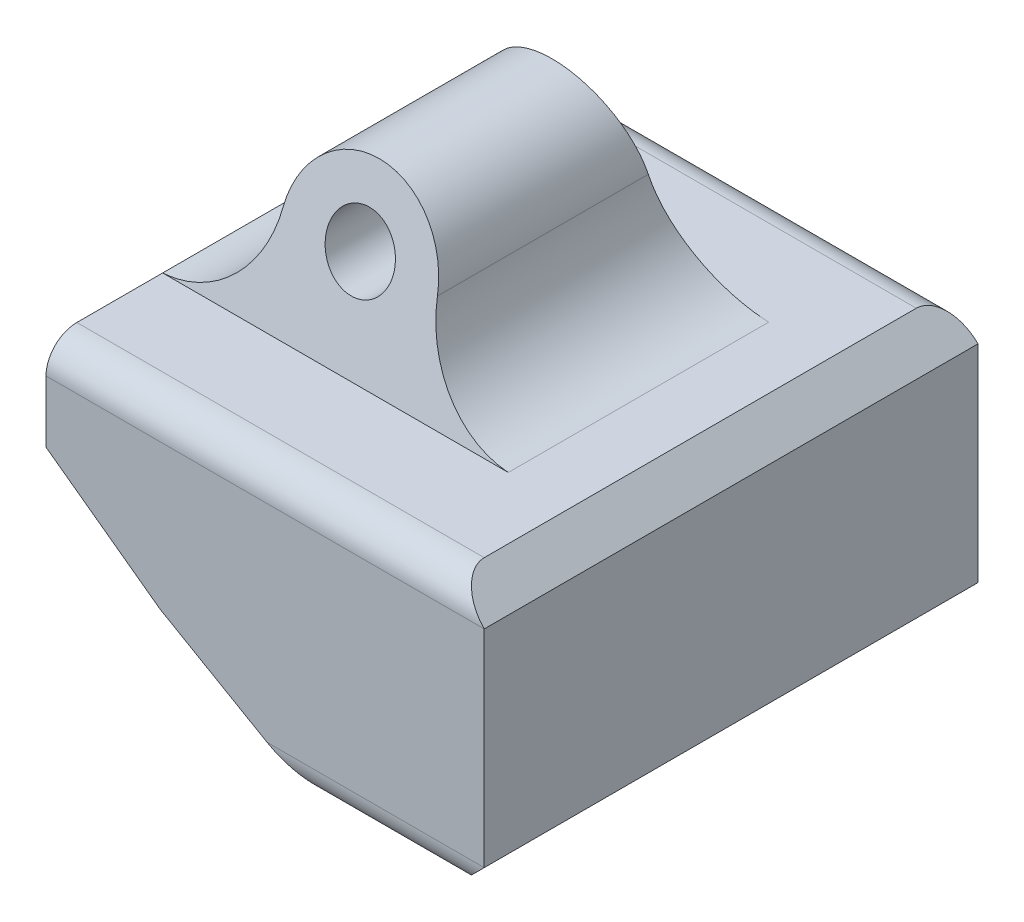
ISO-10303-21;
HEADER;
FILE_DESCRIPTION(('STEP AP214'),'2;1');
FILE_NAME('part.step','',(''),(''),'','','');
FILE_SCHEMA(('AUTOMOTIVE_DESIGN { 1 0 10303 214 1 1 1 1 }'));
ENDSEC;
DATA;
#1=APPLICATION_CONTEXT('core data for automotive mechanical design processes');
#2=APPLICATION_PROTOCOL_DEFINITION('international standard','automotive_design',2000,#1);
#3=PRODUCT_CONTEXT('',#1,'mechanical');
#4=PRODUCT('Part','Part','',(#3));
#5=PRODUCT_RELATED_PRODUCT_CATEGORY('part','',(#4));
#6=PRODUCT_DEFINITION_FORMATION('','',#4);
#7=PRODUCT_DEFINITION_CONTEXT('part definition',#1,'design');
#8=PRODUCT_DEFINITION('design','',#6,#7);
#9=PRODUCT_DEFINITION_SHAPE('','',#8);
#10=(LENGTH_UNIT() NAMED_UNIT(*) SI_UNIT(.MILLI.,.METRE.));
#11=(NAMED_UNIT(*) PLANE_ANGLE_UNIT() SI_UNIT($,.RADIAN.));
#12=(NAMED_UNIT(*) SI_UNIT($,.STERADIAN.) SOLID_ANGLE_UNIT());
#13=UNCERTAINTY_MEASURE_WITH_UNIT(LENGTH_MEASURE(1.E-05),#10,'distance_accuracy_value','');
#14=(GEOMETRIC_REPRESENTATION_CONTEXT(3) GLOBAL_UNCERTAINTY_ASSIGNED_CONTEXT((#13)) GLOBAL_UNIT_ASSIGNED_CONTEXT((#10,
#11,#12)) REPRESENTATION_CONTEXT('',''));
#15=CARTESIAN_POINT('',(0.,0.,0.));
#16=DIRECTION('',(0.,0.,1.));
#17=DIRECTION('',(1.,0.,0.));
#18=AXIS2_PLACEMENT_3D('',#15,#16,#17);
#19=CARTESIAN_POINT('',(-69.6,13.2,-8.));
#20=DIRECTION('',(-0.589469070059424,-0.807790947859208,0.));
#21=DIRECTION('',(0.807790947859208,-0.589469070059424,0.));
#22=AXIS2_PLACEMENT_3D('',#19,#20,#21);
#23=PLANE('',#22);
#24=DIRECTION('',(-0.807790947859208,0.589469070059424,0.));
#25=VECTOR('',#24,1.);
#26=CARTESIAN_POINT('',(-69.6,13.2,6.));
#27=LINE('',#26,#25);
#28=CARTESIAN_POINT('',(-65.9,10.5,6.));
#29=VERTEX_POINT('',#28);
#30=CARTESIAN_POINT('',(-69.6,13.2,6.));
#31=VERTEX_POINT('',#30);
#32=EDGE_CURVE('E220',#29,#31,#27,.T.);
#33=ORIENTED_EDGE('',*,*,#32,.F.);
#34=DIRECTION('',(0.,0.,1.));
#35=VECTOR('',#34,1.);
#36=CARTESIAN_POINT('',(-65.9,10.5,-8.));
#37=LINE('',#36,#35);
#38=CARTESIAN_POINT('',(-65.9,10.5,8.));
#39=VERTEX_POINT('',#38);
#40=EDGE_CURVE('E341',#29,#39,#37,.T.);
#41=ORIENTED_EDGE('',*,*,#40,.T.);
#42=DIRECTION('',(0.807790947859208,-0.589469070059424,0.));
#43=VECTOR('',#42,1.);
#44=CARTESIAN_POINT('',(-69.6,13.2,8.));
#45=LINE('',#44,#43);
#46=CARTESIAN_POINT('',(-69.6,13.2,8.));
#47=VERTEX_POINT('',#46);
#48=EDGE_CURVE('E322',#47,#39,#45,.T.);
#49=ORIENTED_EDGE('',*,*,#48,.F.);
#50=DIRECTION('',(0.,0.,1.));
#51=VECTOR('',#50,1.);
#52=CARTESIAN_POINT('',(-69.6,13.2,-8.));
#53=LINE('',#52,#51);
#54=EDGE_CURVE('E195',#31,#47,#53,.T.);
#55=ORIENTED_EDGE('',*,*,#54,.F.);
#56=EDGE_LOOP('',(#33,#41,#49,#55));
#57=FACE_BOUND('',#56,.T.);
#58=ADVANCED_FACE('F37',(#57),#23,.T.);
#59=CARTESIAN_POINT('',(-55.4,16.2,-8.));
#60=DIRECTION('',(0.,1.,0.));
#61=DIRECTION('',(0.,0.,1.));
#62=AXIS2_PLACEMENT_3D('',#59,#60,#61);
#63=PLANE('',#62);
#64=DIRECTION('',(0.,0.,1.));
#65=VECTOR('',#64,1.);
#66=CARTESIAN_POINT('',(-58.4,16.2,-7.));
#67=LINE('',#66,#65);
#68=CARTESIAN_POINT('',(-58.4,16.2,-4.22013071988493));
#69=VERTEX_POINT('',#68);
#70=CARTESIAN_POINT('',(-58.3999999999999,16.2,4.22013071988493));
#71=VERTEX_POINT('',#70);
#72=EDGE_CURVE('E285',#69,#71,#67,.T.);
#73=ORIENTED_EDGE('',*,*,#72,.T.);
#74=DIRECTION('',(-1.,0.,0.));
#75=VECTOR('',#74,1.);
#76=CARTESIAN_POINT('',(-54.6,16.2,4.22013071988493));
#77=LINE('',#76,#75);
#78=CARTESIAN_POINT('',(-69.6,16.2,4.22013071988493));
#79=VERTEX_POINT('',#78);
#80=EDGE_CURVE('E187',#71,#79,#77,.T.);
#81=ORIENTED_EDGE('',*,*,#80,.T.);
#82=DIRECTION('',(0.,0.,1.));
#83=VECTOR('',#82,1.);
#84=CARTESIAN_POINT('',(-69.6,16.2,9.76990159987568));
#85=LINE('',#84,#83);
#86=CARTESIAN_POINT('',(-69.6,16.2,7.));
#87=VERTEX_POINT('',#86);
#88=EDGE_CURVE('E188',#79,#87,#85,.T.);
#89=ORIENTED_EDGE('',*,*,#88,.T.);
#90=DIRECTION('',(-1.,0.,0.));
#91=VECTOR('',#90,1.);
#92=CARTESIAN_POINT('',(-55.4,16.2,7.));
#93=LINE('',#92,#91);
#94=CARTESIAN_POINT('',(-56.4,16.2,7.));
#95=VERTEX_POINT('',#94);
#96=EDGE_CURVE('E61',#87,#95,#93,.F.);
#97=ORIENTED_EDGE('',*,*,#96,.T.);
#98=DIRECTION('',(0.,0.,-1.));
#99=VECTOR('',#98,1.);
#100=CARTESIAN_POINT('',(-56.4,16.2,-8.));
#101=LINE('',#100,#99);
#102=CARTESIAN_POINT('',(-56.4,16.2,-7.));
#103=VERTEX_POINT('',#102);
#104=EDGE_CURVE('E47',#95,#103,#101,.T.);
#105=ORIENTED_EDGE('',*,*,#104,.T.);
#106=DIRECTION('',(1.,0.,0.));
#107=VECTOR('',#106,1.);
#108=CARTESIAN_POINT('',(-58.4,16.2,-7.));
#109=LINE('',#108,#107);
#110=CARTESIAN_POINT('',(-69.6,16.2,-7.));
#111=VERTEX_POINT('',#110);
#112=EDGE_CURVE('E54',#111,#103,#109,.T.);
#113=ORIENTED_EDGE('',*,*,#112,.F.);
#114=DIRECTION('',(0.,0.,1.));
#115=VECTOR('',#114,1.);
#116=CARTESIAN_POINT('',(-69.6,16.2,-8.));
#117=LINE('',#116,#115);
#118=CARTESIAN_POINT('',(-69.6,16.2,-4.22013071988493));
#119=VERTEX_POINT('',#118);
#120=EDGE_CURVE('E191',#111,#119,#117,.T.);
#121=ORIENTED_EDGE('',*,*,#120,.T.);
#122=DIRECTION('',(-1.,0.,0.));
#123=VECTOR('',#122,1.);
#124=CARTESIAN_POINT('',(-54.6,16.2,-4.22013071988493));
#125=LINE('',#124,#123);
#126=EDGE_CURVE('E176',#69,#119,#125,.T.);
#127=ORIENTED_EDGE('',*,*,#126,.F.);
#128=EDGE_LOOP('',(#73,#81,#89,#97,#105,#113,#121,#127));
#129=FACE_BOUND('',#128,.T.);
#130=ADVANCED_FACE('F192',(#129),#63,.T.);
#131=CARTESIAN_POINT('',(-55.4,16.2,-8.));
#132=DIRECTION('',(1.,0.,0.));
#133=DIRECTION('',(0.,0.,-1.));
#134=AXIS2_PLACEMENT_3D('',#131,#132,#133);
#135=PLANE('',#134);
#136=DIRECTION('',(0.,1.,0.));
#137=VECTOR('',#136,1.);
#138=CARTESIAN_POINT('',(-55.4,16.2,8.));
#139=LINE('',#138,#137);
#140=CARTESIAN_POINT('',(-55.4,8.49999999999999,8.));
#141=VERTEX_POINT('',#140);
#142=CARTESIAN_POINT('',(-55.4,15.2,8.));
#143=VERTEX_POINT('',#142);
#144=EDGE_CURVE('E328',#141,#143,#139,.T.);
#145=ORIENTED_EDGE('',*,*,#144,.F.);
#146=DIRECTION('',(0.,0.,-1.));
#147=VECTOR('',#146,1.);
#148=CARTESIAN_POINT('',(-55.4,8.49999999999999,-8.));
#149=LINE('',#148,#147);
#150=CARTESIAN_POINT('',(-55.4,8.49999999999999,-8.));
#151=VERTEX_POINT('',#150);
#152=EDGE_CURVE('E261',#141,#151,#149,.T.);
#153=ORIENTED_EDGE('',*,*,#152,.T.);
#154=DIRECTION('',(0.,1.,0.));
#155=VECTOR('',#154,1.);
#156=CARTESIAN_POINT('',(-55.4,16.2,-8.));
#157=LINE('',#156,#155);
#158=CARTESIAN_POINT('',(-55.4,15.2,-8.));
#159=VERTEX_POINT('',#158);
#160=EDGE_CURVE('E210',#151,#159,#157,.T.);
#161=ORIENTED_EDGE('',*,*,#160,.T.);
#162=DIRECTION('',(0.,0.,1.));
#163=VECTOR('',#162,1.);
#164=CARTESIAN_POINT('',(-55.4,15.2,-8.));
#165=LINE('',#164,#163);
#166=EDGE_CURVE('E258',#159,#143,#165,.T.);
#167=ORIENTED_EDGE('',*,*,#166,.T.);
#168=EDGE_LOOP('',(#145,#153,#161,#167));
#169=FACE_BOUND('',#168,.T.);
#170=ADVANCED_FACE('F371',(#169),#135,.T.);
#171=CARTESIAN_POINT('',(-60.7038475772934,7.49999999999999,-8.));
#172=DIRECTION('',(0.,-1.,0.));
#173=DIRECTION('',(0.,0.,-1.));
#174=AXIS2_PLACEMENT_3D('',#171,#172,#173);
#175=PLANE('',#174);
#176=DIRECTION('',(1.,0.,0.));
#177=VECTOR('',#176,1.);
#178=CARTESIAN_POINT('',(-55.4,7.49999999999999,-7.));
#179=LINE('',#178,#177);
#180=CARTESIAN_POINT('',(-60.7038475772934,7.49999999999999,-7.));
#181=VERTEX_POINT('',#180);
#182=CARTESIAN_POINT('',(-56.4,7.49999999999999,-7.));
#183=VERTEX_POINT('',#182);
#184=EDGE_CURVE('E234',#181,#183,#179,.T.);
#185=ORIENTED_EDGE('',*,*,#184,.T.);
#186=DIRECTION('',(0.,0.,1.));
#187=VECTOR('',#186,1.);
#188=CARTESIAN_POINT('',(-56.4,7.49999999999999,-8.));
#189=LINE('',#188,#187);
#190=CARTESIAN_POINT('',(-56.4,7.49999999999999,7.));
#191=VERTEX_POINT('',#190);
#192=EDGE_CURVE('E253',#183,#191,#189,.T.);
#193=ORIENTED_EDGE('',*,*,#192,.T.);
#194=DIRECTION('',(1.,0.,0.));
#195=VECTOR('',#194,1.);
#196=CARTESIAN_POINT('',(-60.7038475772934,7.49999999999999,7.));
#197=LINE('',#196,#195);
#198=CARTESIAN_POINT('',(-60.7038475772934,7.49999999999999,7.));
#199=VERTEX_POINT('',#198);
#200=EDGE_CURVE('E237',#191,#199,#197,.F.);
#201=ORIENTED_EDGE('',*,*,#200,.T.);
#202=DIRECTION('',(0.,0.,1.));
#203=VECTOR('',#202,1.);
#204=CARTESIAN_POINT('',(-60.7038475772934,7.49999999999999,-8.));
#205=LINE('',#204,#203);
#206=EDGE_CURVE('E221',#181,#199,#205,.T.);
#207=ORIENTED_EDGE('',*,*,#206,.F.);
#208=EDGE_LOOP('',(#185,#193,#201,#207));
#209=FACE_BOUND('',#208,.T.);
#210=ADVANCED_FACE('F384',(#209),#175,.T.);
#211=CARTESIAN_POINT('',(-65.9,10.5,-8.));
#212=DIRECTION('',(-0.500000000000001,-0.866025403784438,0.));
#213=DIRECTION('',(0.866025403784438,-0.500000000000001,0.));
#214=AXIS2_PLACEMENT_3D('',#211,#212,#213);
#215=PLANE('',#214);
#216=CARTESIAN_POINT('',(-64.,9.40303448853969,0.));
#217=DIRECTION('',(-0.500000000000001,-0.866025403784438,0.));
#218=DIRECTION('',(-0.866025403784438,0.500000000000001,0.));
#219=AXIS2_PLACEMENT_3D('',#216,#217,#218);
#220=ELLIPSE('',#219,2.88675134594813,2.49999999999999);
#221=CARTESIAN_POINT('',(-65.3803847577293,10.2,-2.0843555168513));
#222=VERTEX_POINT('',#221);
#223=CARTESIAN_POINT('',(-65.3803847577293,10.2,2.0843555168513));
#224=VERTEX_POINT('',#223);
#225=EDGE_CURVE('E293',#222,#224,#220,.T.);
#226=ORIENTED_EDGE('',*,*,#225,.F.);
#227=DIRECTION('',(0.,0.,1.));
#228=VECTOR('',#227,1.);
#229=CARTESIAN_POINT('',(-65.3803847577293,10.2,-8.));
#230=LINE('',#229,#228);
#231=CARTESIAN_POINT('',(-65.3803847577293,10.2,-6.));
#232=VERTEX_POINT('',#231);
#233=EDGE_CURVE('E225',#232,#222,#230,.T.);
#234=ORIENTED_EDGE('',*,*,#233,.F.);
#235=DIRECTION('',(0.866025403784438,-0.500000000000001,0.));
#236=VECTOR('',#235,1.);
#237=CARTESIAN_POINT('',(-65.9,10.5,-6.));
#238=LINE('',#237,#236);
#239=CARTESIAN_POINT('',(-65.9,10.5,-6.));
#240=VERTEX_POINT('',#239);
#241=EDGE_CURVE('E315',#240,#232,#238,.T.);
#242=ORIENTED_EDGE('',*,*,#241,.F.);
#243=CARTESIAN_POINT('',(-65.9,10.5,-8.));
#244=VERTEX_POINT('',#243);
#245=EDGE_CURVE('E339',#244,#240,#37,.T.);
#246=ORIENTED_EDGE('',*,*,#245,.F.);
#247=DIRECTION('',(0.866025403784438,-0.500000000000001,0.));
#248=VECTOR('',#247,1.);
#249=CARTESIAN_POINT('',(-65.9,10.5,-8.));
#250=LINE('',#249,#248);
#251=CARTESIAN_POINT('',(-62.4358983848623,8.49999999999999,-8.));
#252=VERTEX_POINT('',#251);
#253=EDGE_CURVE('E212',#244,#252,#250,.T.);
#254=ORIENTED_EDGE('',*,*,#253,.T.);
#255=CARTESIAN_POINT('',(-62.4358983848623,8.49999999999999,-7.));
#256=DIRECTION('',(-0.500000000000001,-0.866025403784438,0.));
#257=DIRECTION('',(-0.866025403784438,0.500000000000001,0.));
#258=AXIS2_PLACEMENT_3D('',#255,#256,#257);
#259=ELLIPSE('',#258,2.,1.);
#260=EDGE_CURVE('E239',#252,#181,#259,.T.);
#261=ORIENTED_EDGE('',*,*,#260,.T.);
#262=ORIENTED_EDGE('',*,*,#206,.T.);
#263=CARTESIAN_POINT('',(-62.4358983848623,8.49999999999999,7.));
#264=DIRECTION('',(-0.500000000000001,-0.866025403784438,0.));
#265=DIRECTION('',(0.866025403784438,-0.500000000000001,0.));
#266=AXIS2_PLACEMENT_3D('',#263,#264,#265);
#267=ELLIPSE('',#266,2.,1.);
#268=CARTESIAN_POINT('',(-62.4358983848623,8.49999999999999,8.));
#269=VERTEX_POINT('',#268);
#270=EDGE_CURVE('E241',#199,#269,#267,.T.);
#271=ORIENTED_EDGE('',*,*,#270,.T.);
#272=DIRECTION('',(0.866025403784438,-0.500000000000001,0.));
#273=VECTOR('',#272,1.);
#274=CARTESIAN_POINT('',(-65.9,10.5,8.));
#275=LINE('',#274,#273);
#276=EDGE_CURVE('E325',#39,#269,#275,.T.);
#277=ORIENTED_EDGE('',*,*,#276,.F.);
#278=ORIENTED_EDGE('',*,*,#40,.F.);
#279=DIRECTION('',(-0.866025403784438,0.500000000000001,0.));
#280=VECTOR('',#279,1.);
#281=CARTESIAN_POINT('',(-65.9,10.5,6.));
#282=LINE('',#281,#280);
#283=CARTESIAN_POINT('',(-65.3803847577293,10.2,6.));
#284=VERTEX_POINT('',#283);
#285=EDGE_CURVE('E318',#284,#29,#282,.T.);
#286=ORIENTED_EDGE('',*,*,#285,.F.);
#287=EDGE_CURVE('E224',#224,#284,#230,.T.);
#288=ORIENTED_EDGE('',*,*,#287,.F.);
#289=EDGE_LOOP('',(#226,#234,#242,#246,#254,#261,#262,#271,#277,#278,#286,#288));
#290=FACE_BOUND('',#289,.T.);
#291=ADVANCED_FACE('F360',(#290),#215,.T.);
#292=DIRECTION('',(0.807790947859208,-0.589469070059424,0.));
#293=VECTOR('',#292,1.);
#294=CARTESIAN_POINT('',(-69.6,13.2,-6.));
#295=LINE('',#294,#293);
#296=CARTESIAN_POINT('',(-69.6,13.2,-6.));
#297=VERTEX_POINT('',#296);
#298=EDGE_CURVE('E218',#297,#240,#295,.T.);
#299=ORIENTED_EDGE('',*,*,#298,.F.);
#300=CARTESIAN_POINT('',(-69.6,13.2,-8.));
#301=VERTEX_POINT('',#300);
#302=EDGE_CURVE('E216',#301,#297,#53,.T.);
#303=ORIENTED_EDGE('',*,*,#302,.F.);
#304=DIRECTION('',(0.807790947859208,-0.589469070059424,0.));
#305=VECTOR('',#304,1.);
#306=CARTESIAN_POINT('',(-69.6,13.2,-8.));
#307=LINE('',#306,#305);
#308=EDGE_CURVE('E333',#301,#244,#307,.T.);
#309=ORIENTED_EDGE('',*,*,#308,.T.);
#310=ORIENTED_EDGE('',*,*,#245,.T.);
#311=EDGE_LOOP('',(#299,#303,#309,#310));
#312=FACE_BOUND('',#311,.T.);
#313=ADVANCED_FACE('F391',(#312),#23,.T.);
#314=CARTESIAN_POINT('',(-69.6,16.2,-8.));
#315=DIRECTION('',(-1.,0.,0.));
#316=DIRECTION('',(0.,0.,1.));
#317=AXIS2_PLACEMENT_3D('',#314,#315,#316);
#318=PLANE('',#317);
#319=DIRECTION('',(0.,-1.,0.));
#320=VECTOR('',#319,1.);
#321=CARTESIAN_POINT('',(-69.6,16.2,8.));
#322=LINE('',#321,#320);
#323=CARTESIAN_POINT('',(-69.6,15.2,8.));
#324=VERTEX_POINT('',#323);
#325=EDGE_CURVE('E320',#324,#47,#322,.T.);
#326=ORIENTED_EDGE('',*,*,#325,.F.);
#327=CARTESIAN_POINT('',(-69.6,15.2,7.));
#328=DIRECTION('',(-1.,0.,0.));
#329=DIRECTION('',(0.,0.,1.));
#330=AXIS2_PLACEMENT_3D('',#327,#328,#329);
#331=CIRCLE('',#330,1.);
#332=EDGE_CURVE('E245',#324,#87,#331,.T.);
#333=ORIENTED_EDGE('',*,*,#332,.T.);
#334=ORIENTED_EDGE('',*,*,#88,.F.);
#335=EDGE_CURVE('E196',#119,#79,#117,.T.);
#336=ORIENTED_EDGE('',*,*,#335,.F.);
#337=ORIENTED_EDGE('',*,*,#120,.F.);
#338=CARTESIAN_POINT('',(-69.6,15.2,-7.));
#339=DIRECTION('',(-1.,0.,0.));
#340=DIRECTION('',(0.,0.,1.));
#341=AXIS2_PLACEMENT_3D('',#338,#339,#340);
#342=CIRCLE('',#341,1.);
#343=CARTESIAN_POINT('',(-69.6,15.2,-8.));
#344=VERTEX_POINT('',#343);
#345=EDGE_CURVE('E243',#111,#344,#342,.T.);
#346=ORIENTED_EDGE('',*,*,#345,.T.);
#347=DIRECTION('',(0.,-1.,0.));
#348=VECTOR('',#347,1.);
#349=CARTESIAN_POINT('',(-69.6,16.2,-8.));
#350=LINE('',#349,#348);
#351=EDGE_CURVE('E331',#344,#301,#350,.T.);
#352=ORIENTED_EDGE('',*,*,#351,.T.);
#353=ORIENTED_EDGE('',*,*,#302,.T.);
#354=EDGE_CURVE('E349',#297,#31,#53,.T.);
#355=ORIENTED_EDGE('',*,*,#354,.T.);
#356=ORIENTED_EDGE('',*,*,#54,.T.);
#357=EDGE_LOOP('',(#326,#333,#334,#336,#337,#346,#352,#353,#355,#356));
#358=FACE_BOUND('',#357,.T.);
#359=ADVANCED_FACE('F208',(#358),#318,.T.);
#360=CARTESIAN_POINT('',(0.,0.,-8.));
#361=DIRECTION('',(0.,0.,1.));
#362=DIRECTION('',(1.,0.,0.));
#363=AXIS2_PLACEMENT_3D('',#360,#361,#362);
#364=PLANE('',#363);
#365=ORIENTED_EDGE('',*,*,#160,.F.);
#366=DIRECTION('',(1.,0.,0.));
#367=VECTOR('',#366,1.);
#368=CARTESIAN_POINT('',(-60.7038475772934,8.49999999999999,-8.));
#369=LINE('',#368,#367);
#370=EDGE_CURVE('E251',#151,#252,#369,.F.);
#371=ORIENTED_EDGE('',*,*,#370,.T.);
#372=ORIENTED_EDGE('',*,*,#253,.F.);
#373=ORIENTED_EDGE('',*,*,#308,.F.);
#374=ORIENTED_EDGE('',*,*,#351,.F.);
#375=DIRECTION('',(-1.,0.,0.));
#376=VECTOR('',#375,1.);
#377=CARTESIAN_POINT('',(-55.4,15.2,-8.));
#378=LINE('',#377,#376);
#379=EDGE_CURVE('E248',#344,#159,#378,.F.);
#380=ORIENTED_EDGE('',*,*,#379,.T.);
#381=EDGE_LOOP('',(#365,#371,#372,#373,#374,#380));
#382=FACE_BOUND('',#381,.T.);
#383=ADVANCED_FACE('F405',(#382),#364,.F.);
#384=CARTESIAN_POINT('',(0.,0.,8.));
#385=DIRECTION('',(0.,0.,1.));
#386=DIRECTION('',(1.,0.,0.));
#387=AXIS2_PLACEMENT_3D('',#384,#385,#386);
#388=PLANE('',#387);
#389=ORIENTED_EDGE('',*,*,#276,.T.);
#390=DIRECTION('',(1.,0.,0.));
#391=VECTOR('',#390,1.);
#392=CARTESIAN_POINT('',(0.,8.49999999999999,8.));
#393=LINE('',#392,#391);
#394=EDGE_CURVE('E231',#269,#141,#393,.T.);
#395=ORIENTED_EDGE('',*,*,#394,.T.);
#396=ORIENTED_EDGE('',*,*,#144,.T.);
#397=DIRECTION('',(-1.,0.,0.));
#398=VECTOR('',#397,1.);
#399=CARTESIAN_POINT('',(0.,15.2,8.));
#400=LINE('',#399,#398);
#401=EDGE_CURVE('E228',#143,#324,#400,.T.);
#402=ORIENTED_EDGE('',*,*,#401,.T.);
#403=ORIENTED_EDGE('',*,*,#325,.T.);
#404=ORIENTED_EDGE('',*,*,#48,.T.);
#405=EDGE_LOOP('',(#389,#395,#396,#402,#403,#404));
#406=FACE_BOUND('',#405,.T.);
#407=ADVANCED_FACE('F356',(#406),#388,.T.);
#408=CARTESIAN_POINT('',(-64.,10.2,0.));
#409=DIRECTION('',(0.,1.,0.));
#410=DIRECTION('',(0.,0.,1.));
#411=AXIS2_PLACEMENT_3D('',#408,#409,#410);
#412=CYLINDRICAL_SURFACE('',#411,6.);
#413=CARTESIAN_POINT('',(-64.,13.2,0.));
#414=DIRECTION('',(0.,1.,0.));
#415=DIRECTION('',(0.,0.,-1.));
#416=AXIS2_PLACEMENT_3D('',#413,#414,#415);
#417=CIRCLE('',#416,6.);
#418=CARTESIAN_POINT('',(-64.,13.2,6.));
#419=VERTEX_POINT('',#418);
#420=CARTESIAN_POINT('',(-64.,13.2,-6.));
#421=VERTEX_POINT('',#420);
#422=EDGE_CURVE('E295',#419,#421,#417,.T.);
#423=ORIENTED_EDGE('',*,*,#422,.T.);
#424=DIRECTION('',(0.,1.,0.));
#425=VECTOR('',#424,1.);
#426=CARTESIAN_POINT('',(-64.,10.2,-6.));
#427=LINE('',#426,#425);
#428=CARTESIAN_POINT('',(-64.,10.2,-6.));
#429=VERTEX_POINT('',#428);
#430=EDGE_CURVE('E305',#429,#421,#427,.T.);
#431=ORIENTED_EDGE('',*,*,#430,.F.);
#432=CARTESIAN_POINT('',(-64.,10.2,0.));
#433=DIRECTION('',(0.,1.,0.));
#434=DIRECTION('',(0.,0.,-1.));
#435=AXIS2_PLACEMENT_3D('',#432,#433,#434);
#436=CIRCLE('',#435,6.);
#437=CARTESIAN_POINT('',(-64.,10.2,6.));
#438=VERTEX_POINT('',#437);
#439=EDGE_CURVE('E296',#438,#429,#436,.T.);
#440=ORIENTED_EDGE('',*,*,#439,.F.);
#441=DIRECTION('',(0.,1.,0.));
#442=VECTOR('',#441,1.);
#443=CARTESIAN_POINT('',(-64.,10.2,6.));
#444=LINE('',#443,#442);
#445=EDGE_CURVE('E312',#438,#419,#444,.T.);
#446=ORIENTED_EDGE('',*,*,#445,.T.);
#447=EDGE_LOOP('',(#423,#431,#440,#446));
#448=FACE_BOUND('',#447,.T.);
#449=ADVANCED_FACE('F422',(#448),#412,.F.);
#450=CARTESIAN_POINT('',(-64.,10.2,6.));
#451=DIRECTION('',(0.,0.,1.));
#452=DIRECTION('',(1.,0.,0.));
#453=AXIS2_PLACEMENT_3D('',#450,#451,#452);
#454=PLANE('',#453);
#455=ORIENTED_EDGE('',*,*,#285,.T.);
#456=ORIENTED_EDGE('',*,*,#32,.T.);
#457=DIRECTION('',(1.,0.,0.));
#458=VECTOR('',#457,1.);
#459=CARTESIAN_POINT('',(-64.,13.2,6.));
#460=LINE('',#459,#458);
#461=EDGE_CURVE('E300',#31,#419,#460,.T.);
#462=ORIENTED_EDGE('',*,*,#461,.T.);
#463=ORIENTED_EDGE('',*,*,#445,.F.);
#464=DIRECTION('',(1.,0.,0.));
#465=VECTOR('',#464,1.);
#466=CARTESIAN_POINT('',(-64.,10.2,6.));
#467=LINE('',#466,#465);
#468=EDGE_CURVE('E303',#284,#438,#467,.T.);
#469=ORIENTED_EDGE('',*,*,#468,.F.);
#470=EDGE_LOOP('',(#455,#456,#462,#463,#469));
#471=FACE_BOUND('',#470,.T.);
#472=ADVANCED_FACE('F426',(#471),#454,.F.);
#473=CARTESIAN_POINT('',(-76.6532797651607,10.2,-6.));
#474=DIRECTION('',(0.,0.,-1.));
#475=DIRECTION('',(-1.,0.,0.));
#476=AXIS2_PLACEMENT_3D('',#473,#474,#475);
#477=PLANE('',#476);
#478=ORIENTED_EDGE('',*,*,#241,.T.);
#479=DIRECTION('',(-1.,0.,0.));
#480=VECTOR('',#479,1.);
#481=CARTESIAN_POINT('',(-76.6532797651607,10.2,-6.));
#482=LINE('',#481,#480);
#483=EDGE_CURVE('E299',#429,#232,#482,.T.);
#484=ORIENTED_EDGE('',*,*,#483,.F.);
#485=ORIENTED_EDGE('',*,*,#430,.T.);
#486=DIRECTION('',(-1.,0.,0.));
#487=VECTOR('',#486,1.);
#488=CARTESIAN_POINT('',(-76.6532797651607,13.2,-6.));
#489=LINE('',#488,#487);
#490=EDGE_CURVE('E308',#421,#297,#489,.T.);
#491=ORIENTED_EDGE('',*,*,#490,.T.);
#492=ORIENTED_EDGE('',*,*,#298,.T.);
#493=EDGE_LOOP('',(#478,#484,#485,#491,#492));
#494=FACE_BOUND('',#493,.T.);
#495=ADVANCED_FACE('F409',(#494),#477,.F.);
#496=CARTESIAN_POINT('',(-64.,10.2,0.));
#497=DIRECTION('',(0.,-1.,0.));
#498=DIRECTION('',(0.,0.,-1.));
#499=AXIS2_PLACEMENT_3D('',#496,#497,#498);
#500=PLANE('',#499);
#501=ORIENTED_EDGE('',*,*,#233,.T.);
#502=CARTESIAN_POINT('',(-64.,10.2,0.));
#503=DIRECTION('',(0.,-1.,0.));
#504=DIRECTION('',(0.,0.,-1.));
#505=AXIS2_PLACEMENT_3D('',#502,#503,#504);
#506=CIRCLE('',#505,2.49999999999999);
#507=EDGE_CURVE('E287',#222,#224,#506,.T.);
#508=ORIENTED_EDGE('',*,*,#507,.T.);
#509=ORIENTED_EDGE('',*,*,#287,.T.);
#510=ORIENTED_EDGE('',*,*,#468,.T.);
#511=ORIENTED_EDGE('',*,*,#439,.T.);
#512=ORIENTED_EDGE('',*,*,#483,.T.);
#513=EDGE_LOOP('',(#501,#508,#509,#510,#511,#512));
#514=FACE_BOUND('',#513,.T.);
#515=ADVANCED_FACE('F416',(#514),#500,.F.);
#516=CARTESIAN_POINT('',(-64.,13.2,0.));
#517=DIRECTION('',(0.,-1.,0.));
#518=DIRECTION('',(0.,0.,-1.));
#519=AXIS2_PLACEMENT_3D('',#516,#517,#518);
#520=PLANE('',#519);
#521=ORIENTED_EDGE('',*,*,#490,.F.);
#522=ORIENTED_EDGE('',*,*,#422,.F.);
#523=ORIENTED_EDGE('',*,*,#461,.F.);
#524=ORIENTED_EDGE('',*,*,#354,.F.);
#525=EDGE_LOOP('',(#521,#522,#523,#524));
#526=FACE_BOUND('',#525,.T.);
#527=ADVANCED_FACE('F421',(#526),#520,.T.);
#528=CARTESIAN_POINT('',(0.,8.49999999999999,7.));
#529=DIRECTION('',(1.,0.,0.));
#530=DIRECTION('',(0.,0.,-1.));
#531=AXIS2_PLACEMENT_3D('',#528,#529,#530);
#532=CYLINDRICAL_SURFACE('',#531,1.);
#533=ORIENTED_EDGE('',*,*,#200,.F.);
#534=CARTESIAN_POINT('',(-55.4,8.49999999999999,7.));
#535=DIRECTION('',(-0.707106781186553,0.707106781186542,0.));
#536=DIRECTION('',(0.707106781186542,0.707106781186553,0.));
#537=AXIS2_PLACEMENT_3D('',#534,#535,#536);
#538=ELLIPSE('',#537,1.41421356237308,1.);
#539=EDGE_CURVE('E256',#191,#141,#538,.T.);
#540=ORIENTED_EDGE('',*,*,#539,.T.);
#541=ORIENTED_EDGE('',*,*,#394,.F.);
#542=ORIENTED_EDGE('',*,*,#270,.F.);
#543=EDGE_LOOP('',(#533,#540,#541,#542));
#544=FACE_BOUND('',#543,.T.);
#545=ADVANCED_FACE('F366',(#544),#532,.T.);
#546=CARTESIAN_POINT('',(0.,15.2,7.));
#547=DIRECTION('',(-1.,0.,0.));
#548=DIRECTION('',(0.,0.,1.));
#549=AXIS2_PLACEMENT_3D('',#546,#547,#548);
#550=CYLINDRICAL_SURFACE('',#549,1.);
#551=ORIENTED_EDGE('',*,*,#401,.F.);
#552=CARTESIAN_POINT('',(-55.4,15.2,7.));
#553=DIRECTION('',(-0.707106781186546,-0.707106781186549,0.));
#554=DIRECTION('',(-0.707106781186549,0.707106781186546,0.));
#555=AXIS2_PLACEMENT_3D('',#552,#553,#554);
#556=ELLIPSE('',#555,1.4142135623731,1.);
#557=EDGE_CURVE('E265',#143,#95,#556,.T.);
#558=ORIENTED_EDGE('',*,*,#557,.T.);
#559=ORIENTED_EDGE('',*,*,#96,.F.);
#560=ORIENTED_EDGE('',*,*,#332,.F.);
#561=EDGE_LOOP('',(#551,#558,#559,#560));
#562=FACE_BOUND('',#561,.T.);
#563=ADVANCED_FACE('F450',(#562),#550,.T.);
#564=CARTESIAN_POINT('',(-60.7038475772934,8.49999999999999,-7.));
#565=DIRECTION('',(-1.,0.,0.));
#566=DIRECTION('',(0.,0.,1.));
#567=AXIS2_PLACEMENT_3D('',#564,#565,#566);
#568=CYLINDRICAL_SURFACE('',#567,1.);
#569=ORIENTED_EDGE('',*,*,#370,.F.);
#570=CARTESIAN_POINT('',(-55.4,8.49999999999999,-7.));
#571=DIRECTION('',(-0.707106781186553,0.707106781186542,0.));
#572=DIRECTION('',(-0.707106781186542,-0.707106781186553,0.));
#573=AXIS2_PLACEMENT_3D('',#570,#571,#572);
#574=ELLIPSE('',#573,1.41421356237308,1.);
#575=EDGE_CURVE('E263',#151,#183,#574,.T.);
#576=ORIENTED_EDGE('',*,*,#575,.T.);
#577=ORIENTED_EDGE('',*,*,#184,.F.);
#578=ORIENTED_EDGE('',*,*,#260,.F.);
#579=EDGE_LOOP('',(#569,#576,#577,#578));
#580=FACE_BOUND('',#579,.T.);
#581=ADVANCED_FACE('F381',(#580),#568,.T.);
#582=CARTESIAN_POINT('',(-55.4,15.2,-7.));
#583=DIRECTION('',(1.,0.,0.));
#584=DIRECTION('',(0.,0.,-1.));
#585=AXIS2_PLACEMENT_3D('',#582,#583,#584);
#586=CYLINDRICAL_SURFACE('',#585,1.);
#587=ORIENTED_EDGE('',*,*,#112,.T.);
#588=CARTESIAN_POINT('',(-55.4,15.2,-7.));
#589=DIRECTION('',(-0.707106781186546,-0.707106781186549,0.));
#590=DIRECTION('',(0.707106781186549,-0.707106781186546,0.));
#591=AXIS2_PLACEMENT_3D('',#588,#589,#590);
#592=ELLIPSE('',#591,1.4142135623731,1.);
#593=EDGE_CURVE('E11',#103,#159,#592,.T.);
#594=ORIENTED_EDGE('',*,*,#593,.T.);
#595=ORIENTED_EDGE('',*,*,#379,.F.);
#596=ORIENTED_EDGE('',*,*,#345,.F.);
#597=EDGE_LOOP('',(#587,#594,#595,#596));
#598=FACE_BOUND('',#597,.T.);
#599=ADVANCED_FACE('F457',(#598),#586,.T.);
#600=CARTESIAN_POINT('',(-64.,5.19999999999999,0.));
#601=DIRECTION('',(0.,1.,0.));
#602=DIRECTION('',(0.,0.,1.));
#603=AXIS2_PLACEMENT_3D('',#600,#601,#602);
#604=CYLINDRICAL_SURFACE('',#603,2.49999999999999);
#605=ORIENTED_EDGE('',*,*,#225,.T.);
#606=ORIENTED_EDGE('',*,*,#507,.F.);
#607=EDGE_LOOP('',(#605,#606));
#608=FACE_BOUND('',#607,.T.);
#609=ADVANCED_FACE('F462',(#608),#604,.F.);
#610=CARTESIAN_POINT('',(-58.2345895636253,19.4725907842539,-7.));
#611=DIRECTION('',(0.,0.,1.));
#612=DIRECTION('',(1.,0.,0.));
#613=AXIS2_PLACEMENT_3D('',#610,#611,#612);
#614=CYLINDRICAL_SURFACE('',#613,3.27676838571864);
#615=CARTESIAN_POINT('',(-58.2345895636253,19.4725907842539,3.34324266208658));
#616=DIRECTION('',(0.,-0.258819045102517,-0.965925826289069));
#617=DIRECTION('',(0.,-0.965925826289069,0.258819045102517));
#618=AXIS2_PLACEMENT_3D('',#615,#616,#617);
#619=ELLIPSE('',#618,3.3923602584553,3.27676838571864);
#620=CARTESIAN_POINT('',(-61.5,19.2,3.41628314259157));
#621=VERTEX_POINT('',#620);
#622=EDGE_CURVE('E281',#71,#621,#619,.T.);
#623=ORIENTED_EDGE('',*,*,#622,.F.);
#624=ORIENTED_EDGE('',*,*,#72,.F.);
#625=CARTESIAN_POINT('',(-58.2345895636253,19.4725907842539,-3.34324266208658));
#626=DIRECTION('',(0.,-0.258819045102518,0.965925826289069));
#627=DIRECTION('',(0.,0.965925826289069,0.258819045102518));
#628=AXIS2_PLACEMENT_3D('',#625,#626,#627);
#629=ELLIPSE('',#628,3.39236025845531,3.27676838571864);
#630=CARTESIAN_POINT('',(-61.5,19.2,-3.41628314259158));
#631=VERTEX_POINT('',#630);
#632=EDGE_CURVE('E184',#631,#69,#629,.T.);
#633=ORIENTED_EDGE('',*,*,#632,.F.);
#634=DIRECTION('',(0.,0.,1.));
#635=VECTOR('',#634,1.);
#636=CARTESIAN_POINT('',(-61.5,19.2,-7.));
#637=LINE('',#636,#635);
#638=EDGE_CURVE('E284',#631,#621,#637,.T.);
#639=ORIENTED_EDGE('',*,*,#638,.T.);
#640=EDGE_LOOP('',(#623,#624,#633,#639));
#641=FACE_BOUND('',#640,.T.);
#642=ADVANCED_FACE('F478',(#641),#614,.F.);
#643=CARTESIAN_POINT('',(-69.7654104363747,19.4725907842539,-7.));
#644=DIRECTION('',(0.,0.,1.));
#645=DIRECTION('',(1.,0.,0.));
#646=AXIS2_PLACEMENT_3D('',#643,#644,#645);
#647=CYLINDRICAL_SURFACE('',#646,3.27676838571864);
#648=CARTESIAN_POINT('',(-69.7654104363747,19.4725907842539,3.34324266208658));
#649=DIRECTION('',(0.,-0.258819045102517,-0.965925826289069));
#650=DIRECTION('',(0.,-0.965925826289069,0.258819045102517));
#651=AXIS2_PLACEMENT_3D('',#648,#649,#650);
#652=ELLIPSE('',#651,3.3923602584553,3.27676838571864);
#653=CARTESIAN_POINT('',(-66.5,19.2,3.41628314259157));
#654=VERTEX_POINT('',#653);
#655=EDGE_CURVE('E279',#654,#79,#652,.T.);
#656=ORIENTED_EDGE('',*,*,#655,.F.);
#657=DIRECTION('',(0.,0.,1.));
#658=VECTOR('',#657,1.);
#659=CARTESIAN_POINT('',(-66.5,19.2,-7.));
#660=LINE('',#659,#658);
#661=CARTESIAN_POINT('',(-66.5,19.2,-3.41628314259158));
#662=VERTEX_POINT('',#661);
#663=EDGE_CURVE('E203',#662,#654,#660,.T.);
#664=ORIENTED_EDGE('',*,*,#663,.F.);
#665=CARTESIAN_POINT('',(-69.7654104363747,19.4725907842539,-3.34324266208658));
#666=DIRECTION('',(0.,-0.258819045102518,0.965925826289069));
#667=DIRECTION('',(0.,0.965925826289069,0.258819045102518));
#668=AXIS2_PLACEMENT_3D('',#665,#666,#667);
#669=ELLIPSE('',#668,3.39236025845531,3.27676838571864);
#670=EDGE_CURVE('E181',#119,#662,#669,.T.);
#671=ORIENTED_EDGE('',*,*,#670,.F.);
#672=ORIENTED_EDGE('',*,*,#335,.T.);
#673=EDGE_LOOP('',(#656,#664,#671,#672));
#674=FACE_BOUND('',#673,.T.);
#675=ADVANCED_FACE('F201',(#674),#647,.F.);
#676=CARTESIAN_POINT('',(-64.,18.9913043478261,-7.));
#677=DIRECTION('',(0.,0.,1.));
#678=DIRECTION('',(1.,0.,0.));
#679=AXIS2_PLACEMENT_3D('',#676,#677,#678);
#680=CYLINDRICAL_SURFACE('',#679,2.50869565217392);
#681=CARTESIAN_POINT('',(-64.,18.9913043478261,3.47220297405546));
#682=DIRECTION('',(0.,-0.258819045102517,-0.965925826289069));
#683=DIRECTION('',(0.,-0.965925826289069,0.258819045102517));
#684=AXIS2_PLACEMENT_3D('',#681,#682,#683);
#685=ELLIPSE('',#684,2.59719285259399,2.50869565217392);
#686=EDGE_CURVE('E277',#621,#654,#685,.F.);
#687=ORIENTED_EDGE('',*,*,#686,.F.);
#688=ORIENTED_EDGE('',*,*,#638,.F.);
#689=CARTESIAN_POINT('',(-64.,18.9913043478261,-3.47220297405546));
#690=DIRECTION('',(0.,-0.258819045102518,0.965925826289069));
#691=DIRECTION('',(0.,0.965925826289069,0.258819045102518));
#692=AXIS2_PLACEMENT_3D('',#689,#690,#691);
#693=ELLIPSE('',#692,2.59719285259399,2.50869565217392);
#694=EDGE_CURVE('E204',#662,#631,#693,.F.);
#695=ORIENTED_EDGE('',*,*,#694,.F.);
#696=ORIENTED_EDGE('',*,*,#663,.T.);
#697=EDGE_LOOP('',(#687,#688,#695,#696));
#698=FACE_BOUND('',#697,.T.);
#699=ADVANCED_FACE('F467',(#698),#680,.T.);
#700=CARTESIAN_POINT('',(-56.4,7.49999999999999,-8.));
#701=DIRECTION('',(-0.707106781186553,0.707106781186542,0.));
#702=DIRECTION('',(0.,0.,1.));
#703=AXIS2_PLACEMENT_3D('',#700,#701,#702);
#704=PLANE('',#703);
#705=ORIENTED_EDGE('',*,*,#575,.F.);
#706=ORIENTED_EDGE('',*,*,#152,.F.);
#707=ORIENTED_EDGE('',*,*,#539,.F.);
#708=ORIENTED_EDGE('',*,*,#192,.F.);
#709=EDGE_LOOP('',(#705,#706,#707,#708));
#710=FACE_BOUND('',#709,.T.);
#711=ADVANCED_FACE('F376',(#710),#704,.F.);
#712=CARTESIAN_POINT('',(-55.4,15.2,-8.));
#713=DIRECTION('',(-0.707106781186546,-0.707106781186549,0.));
#714=DIRECTION('',(0.,0.,1.));
#715=AXIS2_PLACEMENT_3D('',#712,#713,#714);
#716=PLANE('',#715);
#717=ORIENTED_EDGE('',*,*,#593,.F.);
#718=ORIENTED_EDGE('',*,*,#104,.F.);
#719=ORIENTED_EDGE('',*,*,#557,.F.);
#720=ORIENTED_EDGE('',*,*,#166,.F.);
#721=EDGE_LOOP('',(#717,#718,#719,#720));
#722=FACE_BOUND('',#721,.T.);
#723=ADVANCED_FACE('F40',(#722),#716,.F.);
#724=CARTESIAN_POINT('',(-54.6,16.2,4.22013071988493));
#725=DIRECTION('',(0.,-0.258819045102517,-0.965925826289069));
#726=DIRECTION('',(0.,0.965925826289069,-0.258819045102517));
#727=AXIS2_PLACEMENT_3D('',#724,#725,#726);
#728=PLANE('',#727);
#729=ORIENTED_EDGE('',*,*,#622,.T.);
#730=ORIENTED_EDGE('',*,*,#686,.T.);
#731=ORIENTED_EDGE('',*,*,#655,.T.);
#732=ORIENTED_EDGE('',*,*,#80,.F.);
#733=EDGE_LOOP('',(#729,#730,#731,#732));
#734=FACE_BOUND('',#733,.T.);
#735=CARTESIAN_POINT('',(-64.,19.2,3.41628314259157));
#736=DIRECTION('',(0.,-0.258819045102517,-0.965925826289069));
#737=DIRECTION('',(0.,-0.965925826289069,0.258819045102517));
#738=AXIS2_PLACEMENT_3D('',#735,#736,#737);
#739=ELLIPSE('',#738,1.1388037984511,1.10000000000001);
#740=CARTESIAN_POINT('',(-64.,18.1,3.7110272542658));
#741=VERTEX_POINT('',#740);
#742=EDGE_CURVE('E42',#741,#741,#739,.F.);
#743=ORIENTED_EDGE('',*,*,#742,.F.);
#744=EDGE_LOOP('',(#743));
#745=FACE_BOUND('',#744,.T.);
#746=ADVANCED_FACE('F472',(#734,#745),#728,.F.);
#747=CARTESIAN_POINT('',(-64.,19.2,-7.));
#748=DIRECTION('',(0.,0.,1.));
#749=DIRECTION('',(1.,0.,0.));
#750=AXIS2_PLACEMENT_3D('',#747,#748,#749);
#751=CYLINDRICAL_SURFACE('',#750,1.10000000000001);
#752=ORIENTED_EDGE('',*,*,#742,.T.);
#753=EDGE_LOOP('',(#752));
#754=FACE_BOUND('',#753,.T.);
#755=CARTESIAN_POINT('',(-64.,19.2,-3.41628314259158));
#756=DIRECTION('',(0.,-0.258819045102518,0.965925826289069));
#757=DIRECTION('',(0.,0.965925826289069,0.258819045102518));
#758=AXIS2_PLACEMENT_3D('',#755,#756,#757);
#759=ELLIPSE('',#758,1.1388037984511,1.10000000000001);
#760=CARTESIAN_POINT('',(-64.,20.3,-3.12153903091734));
#761=VERTEX_POINT('',#760);
#762=EDGE_CURVE('E267',#761,#761,#759,.F.);
#763=ORIENTED_EDGE('',*,*,#762,.T.);
#764=EDGE_LOOP('',(#763));
#765=FACE_BOUND('',#764,.T.);
#766=ADVANCED_FACE('F571',(#754,#765),#751,.F.);
#767=CARTESIAN_POINT('',(-54.6,16.2,-4.22013071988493));
#768=DIRECTION('',(0.,-0.258819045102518,0.965925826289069));
#769=DIRECTION('',(0.,-0.965925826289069,-0.258819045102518));
#770=AXIS2_PLACEMENT_3D('',#767,#768,#769);
#771=PLANE('',#770);
#772=ORIENTED_EDGE('',*,*,#632,.T.);
#773=ORIENTED_EDGE('',*,*,#126,.T.);
#774=ORIENTED_EDGE('',*,*,#670,.T.);
#775=ORIENTED_EDGE('',*,*,#694,.T.);
#776=EDGE_LOOP('',(#772,#773,#774,#775));
#777=FACE_BOUND('',#776,.T.);
#778=ORIENTED_EDGE('',*,*,#762,.F.);
#779=EDGE_LOOP('',(#778));
#780=FACE_BOUND('',#779,.T.);
#781=ADVANCED_FACE('F178',(#777,#780),#771,.F.);
#782=CLOSED_SHELL('',(#58,#130,#170,#210,#291,#313,#359,#383,#407,#449,#472,#495,#515,#527,#545,
#563,#581,#599,#609,#642,#675,#699,#711,#723,#746,#766,#781));
#783=MANIFOLD_SOLID_BREP('B2',#782);
#784=ADVANCED_BREP_SHAPE_REPRESENTATION('',(#18,#783),#14);
#785=SHAPE_DEFINITION_REPRESENTATION(#9,#784);
ENDSEC;
END-ISO-10303-21;
